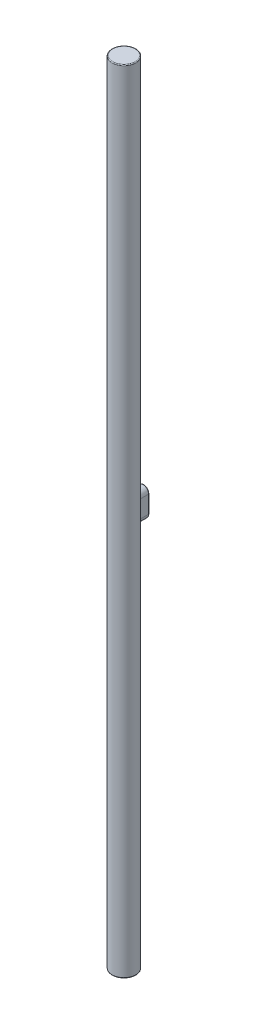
ISO-10303-21;
HEADER;
FILE_DESCRIPTION(('STEP AP214'),'2;1');
FILE_NAME('part.step','',(''),(''),'','','');
FILE_SCHEMA(('AUTOMOTIVE_DESIGN { 1 0 10303 214 1 1 1 1 }'));
ENDSEC;
DATA;
#1=APPLICATION_CONTEXT('core data for automotive mechanical design processes');
#2=APPLICATION_PROTOCOL_DEFINITION('international standard','automotive_design',2000,#1);
#3=PRODUCT_CONTEXT('',#1,'mechanical');
#4=PRODUCT('Part','Part','',(#3));
#5=PRODUCT_RELATED_PRODUCT_CATEGORY('part','',(#4));
#6=PRODUCT_DEFINITION_FORMATION('','',#4);
#7=PRODUCT_DEFINITION_CONTEXT('part definition',#1,'design');
#8=PRODUCT_DEFINITION('design','',#6,#7);
#9=PRODUCT_DEFINITION_SHAPE('','',#8);
#10=(LENGTH_UNIT() NAMED_UNIT(*) SI_UNIT(.MILLI.,.METRE.));
#11=(NAMED_UNIT(*) PLANE_ANGLE_UNIT() SI_UNIT($,.RADIAN.));
#12=(NAMED_UNIT(*) SI_UNIT($,.STERADIAN.) SOLID_ANGLE_UNIT());
#13=UNCERTAINTY_MEASURE_WITH_UNIT(LENGTH_MEASURE(1.E-05),#10,'distance_accuracy_value','');
#14=(GEOMETRIC_REPRESENTATION_CONTEXT(3) GLOBAL_UNCERTAINTY_ASSIGNED_CONTEXT((#13)) GLOBAL_UNIT_ASSIGNED_CONTEXT((#10,
#11,#12)) REPRESENTATION_CONTEXT('',''));
#15=CARTESIAN_POINT('',(0.,0.,0.));
#16=DIRECTION('',(0.,0.,1.));
#17=DIRECTION('',(1.,0.,0.));
#18=AXIS2_PLACEMENT_3D('',#15,#16,#17);
#19=CARTESIAN_POINT('',(0.,500.,0.));
#20=DIRECTION('',(0.,-1.,0.));
#21=DIRECTION('',(0.,0.,-1.));
#22=AXIS2_PLACEMENT_3D('',#19,#20,#21);
#23=CYLINDRICAL_SURFACE('',#22,15.);
#24=DIRECTION('',(0.,-1.,0.));
#25=VECTOR('',#24,1.);
#26=CARTESIAN_POINT('',(-7.0000000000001,500.,-13.2664991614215));
#27=LINE('',#26,#25);
#28=CARTESIAN_POINT('',(-7.00000000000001,11.,-13.2664991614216));
#29=VERTEX_POINT('',#28);
#30=CARTESIAN_POINT('',(-7.,-11.,-13.2664991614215));
#31=VERTEX_POINT('',#30);
#32=EDGE_CURVE('E121',#29,#31,#27,.T.);
#33=ORIENTED_EDGE('',*,*,#32,.T.);
#34=CARTESIAN_POINT('',(-7.,-11.,-13.2664991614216));
#35=CARTESIAN_POINT('',(-7.00003274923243,-11.1851244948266,-13.2664498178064));
#36=CARTESIAN_POINT('',(-6.99265774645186,-11.3702267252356,-13.2703724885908));
#37=CARTESIAN_POINT('',(-6.96334178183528,-11.7388617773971,-13.2857958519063));
#38=CARTESIAN_POINT('',(-6.94140847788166,-11.9223953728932,-13.2972925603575));
#39=CARTESIAN_POINT('',(-6.88337286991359,-12.2856402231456,-13.3274219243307));
#40=CARTESIAN_POINT('',(-6.84734316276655,-12.4653661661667,-13.3460180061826));
#41=CARTESIAN_POINT('',(-6.76154095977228,-12.8207064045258,-13.3896935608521));
#42=CARTESIAN_POINT('',(-6.71176716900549,-12.9963203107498,-13.4147736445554));
#43=CARTESIAN_POINT('',(-6.59910143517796,-13.3419716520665,-13.4705527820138));
#44=CARTESIAN_POINT('',(-6.5362358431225,-13.5120195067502,-13.5012405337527));
#45=CARTESIAN_POINT('',(-6.39789853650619,-13.8459808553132,-13.5673421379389));
#46=CARTESIAN_POINT('',(-6.32242204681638,-14.0098919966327,-13.6027577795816));
#47=CARTESIAN_POINT('',(-6.07778751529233,-14.4914233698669,-13.7146880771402));
#48=CARTESIAN_POINT('',(-5.89046347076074,-14.7987228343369,-13.7968658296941));
#49=CARTESIAN_POINT('',(-5.45752973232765,-15.4002848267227,-13.9740416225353));
#50=CARTESIAN_POINT('',(-5.20873505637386,-15.6920886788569,-14.0695353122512));
#51=CARTESIAN_POINT('',(-4.66630119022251,-16.2318046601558,-14.2586072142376));
#52=CARTESIAN_POINT('',(-4.37265100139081,-16.4797059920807,-14.3521849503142));
#53=CARTESIAN_POINT('',(-3.89437528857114,-16.8202410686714,-14.4866677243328));
#54=CARTESIAN_POINT('',(-3.7235235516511,-16.9310201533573,-14.5316262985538));
#55=CARTESIAN_POINT('',(-3.3720223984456,-17.1376677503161,-14.6171854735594));
#56=CARTESIAN_POINT('',(-3.19137712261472,-17.2335424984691,-14.6577878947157));
#57=CARTESIAN_POINT('',(-2.82147212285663,-17.4094652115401,-14.7334632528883));
#58=CARTESIAN_POINT('',(-2.63221405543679,-17.4895162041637,-14.768537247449));
#59=CARTESIAN_POINT('',(-2.24641271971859,-17.6329454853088,-14.8321215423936));
#60=CARTESIAN_POINT('',(-2.04987011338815,-17.6963252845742,-14.8606324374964));
#61=CARTESIAN_POINT('',(-1.66371033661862,-17.8021742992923,-14.9086383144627));
#62=CARTESIAN_POINT('',(-1.47444294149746,-17.8457136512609,-14.9285899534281));
#63=CARTESIAN_POINT('',(-1.09234411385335,-17.9169751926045,-14.9614017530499));
#64=CARTESIAN_POINT('',(-0.899512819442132,-17.9446979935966,-14.9742621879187));
#65=CARTESIAN_POINT('',(-0.511939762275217,-17.9839703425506,-14.9925161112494));
#66=CARTESIAN_POINT('',(-0.317198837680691,-17.9955266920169,-14.9979127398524));
#67=CARTESIAN_POINT('',(0.0726257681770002,-18.0023368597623,-15.0010903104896));
#68=CARTESIAN_POINT('',(0.267709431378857,-17.9975915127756,-14.9988716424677));
#69=CARTESIAN_POINT('',(0.641717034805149,-17.9728473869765,-14.9873445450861));
#70=CARTESIAN_POINT('',(0.820738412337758,-17.9540398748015,-14.9785898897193));
#71=CARTESIAN_POINT('',(1.17645951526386,-17.9027707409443,-14.9548562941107));
#72=CARTESIAN_POINT('',(1.35315842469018,-17.8703044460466,-14.9398752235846));
#73=CARTESIAN_POINT('',(1.7029066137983,-17.7920696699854,-14.9040599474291));
#74=CARTESIAN_POINT('',(1.87595719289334,-17.7463060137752,-14.8832278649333));
#75=CARTESIAN_POINT('',(2.21744279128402,-17.6419006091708,-14.8361946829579));
#76=CARTESIAN_POINT('',(2.38587601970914,-17.5832539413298,-14.8099915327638));
#77=CARTESIAN_POINT('',(2.71948708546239,-17.4526685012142,-14.7524047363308));
#78=CARTESIAN_POINT('',(2.8845823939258,-17.380549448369,-14.7209515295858));
#79=CARTESIAN_POINT('',(3.20807160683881,-17.22419439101,-14.6538602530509));
#80=CARTESIAN_POINT('',(3.36646305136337,-17.1399539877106,-14.6182206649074));
#81=CARTESIAN_POINT('',(3.83032730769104,-16.8699591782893,-14.5061886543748));
#82=CARTESIAN_POINT('',(4.12468757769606,-16.6668532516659,-14.4246474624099));
#83=CARTESIAN_POINT('',(4.7014055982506,-16.2005767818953,-14.2476513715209));
#84=CARTESIAN_POINT('',(4.9806178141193,-15.933768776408,-14.1516029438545));
#85=CARTESIAN_POINT('',(5.49207336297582,-15.357234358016,-13.9610763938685));
#86=CARTESIAN_POINT('',(5.72428311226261,-15.0474775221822,-13.8665994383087));
#87=CARTESIAN_POINT('',(6.03795030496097,-14.5474792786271,-13.7316077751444));
#88=CARTESIAN_POINT('',(6.13867739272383,-14.3702200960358,-13.6867493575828));
#89=CARTESIAN_POINT('',(6.32466275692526,-14.0067033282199,-13.6018041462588));
#90=CARTESIAN_POINT('',(6.40992781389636,-13.8204497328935,-13.5617152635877));
#91=CARTESIAN_POINT('',(6.56402317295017,-13.4404053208,-13.4878059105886));
#92=CARTESIAN_POINT('',(6.63287915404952,-13.2466268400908,-13.4539756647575));
#93=CARTESIAN_POINT('',(6.7534883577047,-12.85278346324,-13.3938392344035));
#94=CARTESIAN_POINT('',(6.80524910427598,-12.6527213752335,-13.3675297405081));
#95=CARTESIAN_POINT('',(6.89835333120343,-12.2130277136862,-13.3197587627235));
#96=CARTESIAN_POINT('',(6.93638471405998,-11.972497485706,-13.2999040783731));
#97=CARTESIAN_POINT('',(6.97450458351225,-11.6092331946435,-13.279927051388));
#98=CARTESIAN_POINT('',(6.98405670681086,-11.4876733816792,-13.2749021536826));
#99=CARTESIAN_POINT('',(6.99680619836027,-11.244086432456,-13.2681849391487));
#100=CARTESIAN_POINT('',(7.0000013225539,-11.1220591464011,-13.2664937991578));
#101=CARTESIAN_POINT('',(7.,-11.,-13.2664991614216));
#102=B_SPLINE_CURVE_WITH_KNOTS('',3,(#34,#35,#36,#37,#38,#39,#40,#41,#42,#43,#44,#45,#46,#47,
#48,#49,#50,#51,#52,#53,#54,#55,#56,#57,#58,#59,#60,#61,#62,#63,#64,#65,#66,#67,#68,#69,#70,#71,
#72,#73,#74,#75,#76,#77,#78,#79,#80,#81,#82,#83,#84,#85,#86,#87,#88,#89,#90,#91,#92,#93,#94,#95,
#96,#97,#98,#99,#100,#101),.UNSPECIFIED.,.F.,.F.,(4,2,2,2,2,2,2,2,2,2,2,2,2,2,2,2,2,2,2,2,2,2,2,
2,2,2,2,2,2,2,2,2,2,4),(0.,0.555149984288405,1.11000818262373,1.66204568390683,2.21413521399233,
2.76512406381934,3.31632202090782,4.41909352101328,5.59984914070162,6.78089474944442,
7.40580354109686,8.03045016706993,8.65497715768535,9.27944753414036,9.8643670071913,
10.4492638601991,11.0339145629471,11.6185353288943,12.158556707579,12.6987629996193,
13.2387735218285,13.7789906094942,14.3270350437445,14.8752788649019,15.971127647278,
17.1600982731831,18.3499154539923,18.9755024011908,19.6008143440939,20.2251411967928,
20.8491929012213,21.5803389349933,21.9462710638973,22.3123323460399),.UNSPECIFIED.);
#103=CARTESIAN_POINT('',(7.,-11.,-13.2664991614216));
#104=VERTEX_POINT('',#103);
#105=EDGE_CURVE('E101',#31,#104,#102,.T.);
#106=ORIENTED_EDGE('',*,*,#105,.T.);
#107=DIRECTION('',(0.,-1.,0.));
#108=VECTOR('',#107,1.);
#109=CARTESIAN_POINT('',(6.9999999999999,500.,-13.2664991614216));
#110=LINE('',#109,#108);
#111=CARTESIAN_POINT('',(6.9999999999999,11.,-13.2664991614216));
#112=VERTEX_POINT('',#111);
#113=EDGE_CURVE('E111',#104,#112,#110,.F.);
#114=ORIENTED_EDGE('',*,*,#113,.T.);
#115=CARTESIAN_POINT('',(0.,18.,-15.));
#116=CARTESIAN_POINT('',(-0.185527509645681,17.9999987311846,-14.9999989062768));
#117=CARTESIAN_POINT('',(-0.371089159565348,17.9926149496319,-14.9965492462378));
#118=CARTESIAN_POINT('',(-0.740864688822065,17.963156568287,-14.9828363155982));
#119=CARTESIAN_POINT('',(-0.925077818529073,17.9410743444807,-14.9725695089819));
#120=CARTESIAN_POINT('',(-1.29101586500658,17.8824175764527,-14.9454673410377));
#121=CARTESIAN_POINT('',(-1.47273599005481,17.8458183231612,-14.928620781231));
#122=CARTESIAN_POINT('',(-1.8321376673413,17.7585122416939,-14.8887870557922));
#123=CARTESIAN_POINT('',(-2.00981753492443,17.7077996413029,-14.8657973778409));
#124=CARTESIAN_POINT('',(-2.35915888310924,17.5930291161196,-14.8143651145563));
#125=CARTESIAN_POINT('',(-2.53084229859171,17.5290275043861,-14.7859455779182));
#126=CARTESIAN_POINT('',(-2.86799253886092,17.3881154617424,-14.7242659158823));
#127=CARTESIAN_POINT('',(-3.03345697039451,17.3112001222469,-14.6910039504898));
#128=CARTESIAN_POINT('',(-3.35710712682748,17.1451512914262,-14.6204390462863));
#129=CARTESIAN_POINT('',(-3.51529725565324,17.0560253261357,-14.5831385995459));
#130=CARTESIAN_POINT('',(-3.82374236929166,16.8661597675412,-14.5053212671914));
#131=CARTESIAN_POINT('',(-3.97399442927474,16.7654159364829,-14.4648032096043));
#132=CARTESIAN_POINT('',(-4.42760170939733,16.4351670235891,-14.3352174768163));
#133=CARTESIAN_POINT('',(-4.71623752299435,16.1866208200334,-14.2420761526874));
#134=CARTESIAN_POINT('',(-5.24943713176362,15.6462489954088,-14.0543075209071));
#135=CARTESIAN_POINT('',(-5.49397191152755,15.3543951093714,-13.9596792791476));
#136=CARTESIAN_POINT('',(-5.83075411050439,14.8785879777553,-13.8209401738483));
#137=CARTESIAN_POINT('',(-5.94080662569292,14.7078579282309,-13.7738664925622));
#138=CARTESIAN_POINT('',(-6.1460185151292,14.3567480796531,-13.6835306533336));
#139=CARTESIAN_POINT('',(-6.2411840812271,14.1763723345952,-13.640266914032));
#140=CARTESIAN_POINT('',(-6.41576799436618,13.8070684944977,-13.5590265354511));
#141=CARTESIAN_POINT('',(-6.4951904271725,13.6181426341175,-13.5210485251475));
#142=CARTESIAN_POINT('',(-6.63747055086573,13.2329619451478,-13.4517751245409));
#143=CARTESIAN_POINT('',(-6.70032982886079,13.0367078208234,-13.4204790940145));
#144=CARTESIAN_POINT('',(-6.80567082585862,12.6494932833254,-13.3673531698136));
#145=CARTESIAN_POINT('',(-6.84909352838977,12.4588480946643,-13.3450926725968));
#146=CARTESIAN_POINT('',(-6.91991023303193,12.0738452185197,-13.308509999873));
#147=CARTESIAN_POINT('',(-6.94730483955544,11.8794876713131,-13.2941875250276));
#148=CARTESIAN_POINT('',(-6.98566539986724,11.4888472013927,-13.2740706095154));
#149=CARTESIAN_POINT('',(-6.99664232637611,11.2925656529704,-13.268270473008));
#150=CARTESIAN_POINT('',(-7.00203713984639,10.8997185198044,-13.2654245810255));
#151=CARTESIAN_POINT('',(-6.9964562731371,10.703152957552,-13.2683781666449));
#152=CARTESIAN_POINT('',(-6.97022504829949,10.3313397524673,-13.2821739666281));
#153=CARTESIAN_POINT('',(-6.95115599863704,10.1559468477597,-13.2921880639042));
#154=CARTESIAN_POINT('',(-6.89993033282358,9.80753469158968,-13.3188511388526));
#155=CARTESIAN_POINT('',(-6.86776931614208,9.63451625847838,-13.3355023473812));
#156=CARTESIAN_POINT('',(-6.79071696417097,9.29208944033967,-13.3749029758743));
#157=CARTESIAN_POINT('',(-6.74582796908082,9.12268039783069,-13.3976512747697));
#158=CARTESIAN_POINT('',(-6.64374391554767,8.78838761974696,-13.4485656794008));
#159=CARTESIAN_POINT('',(-6.58654406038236,8.62350567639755,-13.476733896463));
#160=CARTESIAN_POINT('',(-6.45890740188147,8.29552875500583,-13.5383766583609));
#161=CARTESIAN_POINT('',(-6.38820027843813,8.13255870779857,-13.5719568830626));
#162=CARTESIAN_POINT('',(-6.23500689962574,7.81313368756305,-13.6430140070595));
#163=CARTESIAN_POINT('',(-6.15251670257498,7.65668091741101,-13.6804922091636));
#164=CARTESIAN_POINT('',(-5.88811674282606,7.19810690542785,-13.7973596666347));
#165=CARTESIAN_POINT('',(-5.68921430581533,6.90660842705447,-13.8812136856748));
#166=CARTESIAN_POINT('',(-5.34868196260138,6.48008319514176,-14.0145878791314));
#167=CARTESIAN_POINT('',(-5.22097547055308,6.33316946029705,-14.062774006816));
#168=CARTESIAN_POINT('',(-4.95377039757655,6.0504618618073,-14.1591066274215));
#169=CARTESIAN_POINT('',(-4.81427497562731,5.91466503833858,-14.2072531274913));
#170=CARTESIAN_POINT('',(-4.52411760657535,5.65487840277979,-14.3022965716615));
#171=CARTESIAN_POINT('',(-4.37344759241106,5.53089727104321,-14.3491925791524));
#172=CARTESIAN_POINT('',(-4.06185463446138,5.29566653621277,-14.4404874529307));
#173=CARTESIAN_POINT('',(-3.90093579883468,5.18441188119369,-14.4848873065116));
#174=CARTESIAN_POINT('',(-3.56364449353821,4.97159845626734,-14.5716107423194));
#175=CARTESIAN_POINT('',(-3.38692345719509,4.87053656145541,-14.6138009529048));
#176=CARTESIAN_POINT('',(-3.02450952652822,4.68384062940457,-14.6930843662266));
#177=CARTESIAN_POINT('',(-2.8388206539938,4.59819975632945,-14.7301798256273));
#178=CARTESIAN_POINT('',(-2.45973540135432,4.44320063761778,-14.7982015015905));
#179=CARTESIAN_POINT('',(-2.26634150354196,4.37383719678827,-14.8291296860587));
#180=CARTESIAN_POINT('',(-1.87328306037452,4.25217654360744,-14.8838894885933));
#181=CARTESIAN_POINT('',(-1.67361913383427,4.19987765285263,-14.9077218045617));
#182=CARTESIAN_POINT('',(-1.2849064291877,4.11628636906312,-14.9460444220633));
#183=CARTESIAN_POINT('',(-1.09618911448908,4.08370962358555,-14.9611026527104));
#184=CARTESIAN_POINT('',(-0.716291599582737,4.03411066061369,-14.9840958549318));
#185=CARTESIAN_POINT('',(-0.525111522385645,4.01708766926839,-14.9920311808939));
#186=CARTESIAN_POINT('',(-0.141899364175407,3.99881076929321,-15.0005528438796));
#187=CARTESIAN_POINT('',(0.0501324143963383,3.9975516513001,-15.0011416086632));
#188=CARTESIAN_POINT('',(0.433528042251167,4.01080539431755,-14.9949593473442));
#189=CARTESIAN_POINT('',(0.624891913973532,4.02531772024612,-14.9881885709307));
#190=CARTESIAN_POINT('',(0.992870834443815,4.06846060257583,-14.9681629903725));
#191=CARTESIAN_POINT('',(1.16962816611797,4.09609987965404,-14.9553639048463));
#192=CARTESIAN_POINT('',(1.52005950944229,4.16470144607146,-14.9238191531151));
#193=CARTESIAN_POINT('',(1.69373244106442,4.20566830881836,-14.9050714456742));
#194=CARTESIAN_POINT('',(2.03675771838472,4.30050187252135,-14.8620823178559));
#195=CARTESIAN_POINT('',(2.20611137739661,4.35436459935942,-14.8378425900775));
#196=CARTESIAN_POINT('',(2.53960724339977,4.47452478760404,-14.7844151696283));
#197=CARTESIAN_POINT('',(2.70374743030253,4.54082700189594,-14.7552255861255));
#198=CARTESIAN_POINT('',(3.03073676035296,4.6874965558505,-14.6916030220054));
#199=CARTESIAN_POINT('',(3.19339683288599,4.7682285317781,-14.6570381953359));
#200=CARTESIAN_POINT('',(3.51134517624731,4.94167648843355,-14.584138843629));
#201=CARTESIAN_POINT('',(3.6666307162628,5.03439686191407,-14.5458029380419));
#202=CARTESIAN_POINT('',(4.12023182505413,5.32957304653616,-14.4264075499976));
#203=CARTESIAN_POINT('',(4.40646643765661,5.54912277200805,-14.3409250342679));
#204=CARTESIAN_POINT('',(4.96471930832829,6.04982570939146,-14.1578733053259));
#205=CARTESIAN_POINT('',(5.23328196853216,6.33469554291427,-14.0599018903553));
#206=CARTESIAN_POINT('',(5.59821974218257,6.79307552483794,-13.9167925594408));
#207=CARTESIAN_POINT('',(5.71362151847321,6.95118059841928,-13.8696962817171));
#208=CARTESIAN_POINT('',(5.93107342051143,7.27700624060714,-13.7781079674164));
#209=CARTESIAN_POINT('',(6.03312871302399,7.4447230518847,-13.733614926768));
#210=CARTESIAN_POINT('',(6.22628880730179,7.79460207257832,-13.6471574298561));
#211=CARTESIAN_POINT('',(6.31692040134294,7.97705847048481,-13.605325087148));
#212=CARTESIAN_POINT('',(6.48226486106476,8.35012418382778,-13.5273278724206));
#213=CARTESIAN_POINT('',(6.55698529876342,8.54072956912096,-13.4911603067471));
#214=CARTESIAN_POINT('',(6.68967957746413,8.92872193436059,-13.4258579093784));
#215=CARTESIAN_POINT('',(6.74766458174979,9.12610429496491,-13.3967183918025));
#216=CARTESIAN_POINT('',(6.84618962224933,9.52619083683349,-13.3466383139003));
#217=CARTESIAN_POINT('',(6.88673191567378,9.7288943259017,-13.3256966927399));
#218=CARTESIAN_POINT('',(6.94693568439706,10.119365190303,-13.2944019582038));
#219=CARTESIAN_POINT('',(6.96815027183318,10.3068313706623,-13.2832643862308));
#220=CARTESIAN_POINT('',(6.99536983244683,10.6831655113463,-13.2689503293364));
#221=CARTESIAN_POINT('',(7.00137576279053,10.8720333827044,-13.2657733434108));
#222=CARTESIAN_POINT('',(6.99809627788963,11.2495502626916,-13.2675035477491));
#223=CARTESIAN_POINT('',(6.98881457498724,11.4381993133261,-13.2724087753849));
#224=CARTESIAN_POINT('',(6.95509456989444,11.8137582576,-13.290109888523));
#225=CARTESIAN_POINT('',(6.93065662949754,12.0006681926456,-13.3029055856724));
#226=CARTESIAN_POINT('',(6.8692843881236,12.3576820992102,-13.3346925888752));
#227=CARTESIAN_POINT('',(6.83339644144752,12.5280143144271,-13.3531614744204));
#228=CARTESIAN_POINT('',(6.7492425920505,12.8649072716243,-13.3958930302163));
#229=CARTESIAN_POINT('',(6.70097250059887,13.0314667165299,-13.4201576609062));
#230=CARTESIAN_POINT('',(6.59251960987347,13.3597822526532,-13.4737648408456));
#231=CARTESIAN_POINT('',(6.53233858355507,13.5215390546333,-13.5031066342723));
#232=CARTESIAN_POINT('',(6.40052875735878,13.839518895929,-13.566081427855));
#233=CARTESIAN_POINT('',(6.32889554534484,13.9957397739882,-13.5997160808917));
#234=CARTESIAN_POINT('',(6.16962215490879,14.3119684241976,-13.6727441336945));
#235=CARTESIAN_POINT('',(6.0812384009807,14.4715478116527,-13.7123709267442));
#236=CARTESIAN_POINT('',(5.89263773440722,14.7828501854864,-13.7944698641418));
#237=CARTESIAN_POINT('',(5.7924167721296,14.9345704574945,-13.8369429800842));
#238=CARTESIAN_POINT('',(5.58073172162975,15.2294661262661,-13.9236674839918));
#239=CARTESIAN_POINT('',(5.46926511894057,15.3726396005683,-13.9679192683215));
#240=CARTESIAN_POINT('',(5.23568066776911,15.6497844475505,-14.0571433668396));
#241=CARTESIAN_POINT('',(5.11356215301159,15.7837552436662,-14.1021157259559));
#242=CARTESIAN_POINT('',(4.84643680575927,16.0548804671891,-14.1962694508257));
#243=CARTESIAN_POINT('',(4.7003634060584,16.1909977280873,-14.2454187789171));
#244=CARTESIAN_POINT('',(4.3968457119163,16.4504676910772,-14.3420047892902));
#245=CARTESIAN_POINT('',(4.23940499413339,16.5738243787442,-14.3894420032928));
#246=CARTESIAN_POINT('',(3.91380631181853,16.8070870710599,-14.4813935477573));
#247=CARTESIAN_POINT('',(3.74563849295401,16.916980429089,-14.525905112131));
#248=CARTESIAN_POINT('',(3.39976003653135,17.1222587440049,-14.6107261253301));
#249=CARTESIAN_POINT('',(3.22205385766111,17.2176504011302,-14.6510375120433));
#250=CARTESIAN_POINT('',(2.85900975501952,17.3926892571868,-14.7261758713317));
#251=CARTESIAN_POINT('',(2.67371235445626,17.4724095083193,-14.7610281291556));
#252=CARTESIAN_POINT('',(2.29606194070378,17.615804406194,-14.8244639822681));
#253=CARTESIAN_POINT('',(2.1037124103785,17.6794868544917,-14.853050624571));
#254=CARTESIAN_POINT('',(1.71380885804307,17.7899797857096,-14.9030669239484));
#255=CARTESIAN_POINT('',(1.51626804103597,17.8368293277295,-14.9245131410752));
#256=CARTESIAN_POINT('',(1.11729196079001,17.9132383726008,-14.9596693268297));
#257=CARTESIAN_POINT('',(0.91585936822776,17.9428093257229,-14.9733844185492));
#258=CARTESIAN_POINT('',(0.594975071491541,17.9756855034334,-14.9886652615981));
#259=CARTESIAN_POINT('',(0.476212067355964,17.9847985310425,-14.9929110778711));
#260=CARTESIAN_POINT('',(0.238304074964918,17.9969562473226,-14.9985788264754));
#261=CARTESIAN_POINT('',(0.119159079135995,18.0000008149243,-15.0000007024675));
#262=CARTESIAN_POINT('',(0.,18.,-15.));
#263=B_SPLINE_CURVE_WITH_KNOTS('',3,(#115,#116,#117,#118,#119,#120,#121,#122,#123,#124,#125,
#126,#127,#128,#129,#130,#131,#132,#133,#134,#135,#136,#137,#138,#139,#140,#141,#142,#143,#144,
#145,#146,#147,#148,#149,#150,#151,#152,#153,#154,#155,#156,#157,#158,#159,#160,#161,#162,#163,
#164,#165,#166,#167,#168,#169,#170,#171,#172,#173,#174,#175,#176,#177,#178,#179,#180,#181,#182,
#183,#184,#185,#186,#187,#188,#189,#190,#191,#192,#193,#194,#195,#196,#197,#198,#199,#200,#201,
#202,#203,#204,#205,#206,#207,#208,#209,#210,#211,#212,#213,#214,#215,#216,#217,#218,#219,#220,
#221,#222,#223,#224,#225,#226,#227,#228,#229,#230,#231,#232,#233,#234,#235,#236,#237,#238,#239,
#240,#241,#242,#243,#244,#245,#246,#247,#248,#249,#250,#251,#252,#253,#254,#255,#256,#257,#258,
#259,#260,#261,#262),.UNSPECIFIED.,.T.,.F.,(4,2,2,2,2,2,2,2,2,2,2,2,2,2,2,2,2,2,2,2,2,2,2,2,2,2,
2,2,2,2,2,2,2,2,2,2,2,2,2,2,2,2,2,2,2,2,2,2,2,2,2,2,2,2,2,2,2,2,2,2,2,2,2,2,2,2,2,2,2,2,2,2,2,
4),(0.,0.556463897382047,1.11321665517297,1.67092114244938,2.22885406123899,2.78446926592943,
3.34029614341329,3.89578196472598,4.45147105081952,5.6225504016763,6.7943974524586,
7.41925763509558,8.0438572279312,8.66829450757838,9.29267193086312,9.88222605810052,
10.4717579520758,11.0608956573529,11.6499890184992,12.1794981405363,12.7091853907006,
13.2387753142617,13.7685719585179,14.3103609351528,14.852331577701,15.9357488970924,
16.5368462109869,17.1377829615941,17.7391578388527,18.3402931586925,18.9631926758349,
19.5858153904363,20.2082391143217,20.8306016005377,21.4061427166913,21.9816551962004,
22.556977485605,23.132280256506,23.6697472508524,24.2073988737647,24.7448850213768,
25.2825769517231,25.8365253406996,26.390677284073,27.4984032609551,28.7034024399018,
29.3068236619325,29.9100105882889,30.5331266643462,31.1559455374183,31.7783479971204,
32.4006698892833,32.9668805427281,33.5330555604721,34.0990931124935,34.6651171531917,
35.1896844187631,35.7144293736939,36.2390962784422,36.763965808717,37.3234087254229,
37.8830435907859,38.4428038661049,39.0025991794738,39.6187477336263,40.2347032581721,
40.8512330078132,41.4674770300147,42.0807765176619,42.6937770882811,43.3053459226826,
43.9165090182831,44.2739029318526,44.6313039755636),.UNSPECIFIED.);
#264=EDGE_CURVE('E116',#112,#29,#263,.T.);
#265=ORIENTED_EDGE('',*,*,#264,.T.);
#266=EDGE_LOOP('',(#33,#106,#114,#265));
#267=FACE_BOUND('',#266,.T.);
#268=CARTESIAN_POINT('',(0.,-499.,0.));
#269=DIRECTION('',(0.,1.,0.));
#270=DIRECTION('',(0.,0.,1.));
#271=AXIS2_PLACEMENT_3D('',#268,#269,#270);
#272=CIRCLE('',#271,15.);
#273=CARTESIAN_POINT('',(0.,-499.,15.));
#274=VERTEX_POINT('',#273);
#275=EDGE_CURVE('E296',#274,#274,#272,.T.);
#276=ORIENTED_EDGE('',*,*,#275,.T.);
#277=EDGE_LOOP('',(#276));
#278=FACE_BOUND('',#277,.T.);
#279=CARTESIAN_POINT('',(0.,499.,0.));
#280=DIRECTION('',(0.,1.,0.));
#281=DIRECTION('',(0.,0.,1.));
#282=AXIS2_PLACEMENT_3D('',#279,#280,#281);
#283=CIRCLE('',#282,15.);
#284=CARTESIAN_POINT('',(0.,499.,15.));
#285=VERTEX_POINT('',#284);
#286=EDGE_CURVE('E293',#285,#285,#283,.F.);
#287=ORIENTED_EDGE('',*,*,#286,.T.);
#288=EDGE_LOOP('',(#287));
#289=FACE_BOUND('',#288,.T.);
#290=ADVANCED_FACE('F44',(#267,#278,#289),#23,.T.);
#291=CARTESIAN_POINT('',(0.,500.,0.));
#292=DIRECTION('',(0.,1.,0.));
#293=DIRECTION('',(0.,0.,1.));
#294=AXIS2_PLACEMENT_3D('',#291,#292,#293);
#295=PLANE('',#294);
#296=CARTESIAN_POINT('',(0.,500.,0.));
#297=DIRECTION('',(0.,1.,0.));
#298=DIRECTION('',(0.,0.,1.));
#299=AXIS2_PLACEMENT_3D('',#296,#297,#298);
#300=CIRCLE('',#299,14.);
#301=CARTESIAN_POINT('',(0.,500.,14.));
#302=VERTEX_POINT('',#301);
#303=EDGE_CURVE('E117',#302,#302,#300,.T.);
#304=ORIENTED_EDGE('',*,*,#303,.T.);
#305=EDGE_LOOP('',(#304));
#306=FACE_BOUND('',#305,.T.);
#307=ADVANCED_FACE('F145',(#306),#295,.T.);
#308=CARTESIAN_POINT('',(0.,-500.,0.));
#309=DIRECTION('',(0.,1.,0.));
#310=DIRECTION('',(0.,0.,1.));
#311=AXIS2_PLACEMENT_3D('',#308,#309,#310);
#312=PLANE('',#311);
#313=CARTESIAN_POINT('',(0.,-500.,0.));
#314=DIRECTION('',(0.,1.,0.));
#315=DIRECTION('',(0.,0.,1.));
#316=AXIS2_PLACEMENT_3D('',#313,#314,#315);
#317=CIRCLE('',#316,14.);
#318=CARTESIAN_POINT('',(0.,-500.,14.));
#319=VERTEX_POINT('',#318);
#320=EDGE_CURVE('E299',#319,#319,#317,.F.);
#321=ORIENTED_EDGE('',*,*,#320,.T.);
#322=EDGE_LOOP('',(#321));
#323=FACE_BOUND('',#322,.T.);
#324=ADVANCED_FACE('F147',(#323),#312,.F.);
#325=CARTESIAN_POINT('',(0.,-499.,0.));
#326=DIRECTION('',(0.,1.,0.));
#327=DIRECTION('',(0.,0.,1.));
#328=AXIS2_PLACEMENT_3D('',#325,#326,#327);
#329=TOROIDAL_SURFACE('',#328,14.,1.);
#330=ORIENTED_EDGE('',*,*,#320,.F.);
#331=EDGE_LOOP('',(#330));
#332=FACE_BOUND('',#331,.T.);
#333=ORIENTED_EDGE('',*,*,#275,.F.);
#334=EDGE_LOOP('',(#333));
#335=FACE_BOUND('',#334,.T.);
#336=ADVANCED_FACE('F150',(#332,#335),#329,.T.);
#337=CARTESIAN_POINT('',(0.,499.,0.));
#338=DIRECTION('',(0.,1.,0.));
#339=DIRECTION('',(0.,0.,1.));
#340=AXIS2_PLACEMENT_3D('',#337,#338,#339);
#341=TOROIDAL_SURFACE('',#340,14.,1.);
#342=ORIENTED_EDGE('',*,*,#286,.F.);
#343=EDGE_LOOP('',(#342));
#344=FACE_BOUND('',#343,.T.);
#345=ORIENTED_EDGE('',*,*,#303,.F.);
#346=EDGE_LOOP('',(#345));
#347=FACE_BOUND('',#346,.T.);
#348=ADVANCED_FACE('F143',(#344,#347),#341,.T.);
#349=CARTESIAN_POINT('',(0.,-11.,-25.));
#350=DIRECTION('',(0.,0.,1.));
#351=DIRECTION('',(1.,0.,0.));
#352=AXIS2_PLACEMENT_3D('',#349,#350,#351);
#353=CYLINDRICAL_SURFACE('',#352,7.);
#354=DIRECTION('',(0.,0.,1.));
#355=VECTOR('',#354,1.);
#356=CARTESIAN_POINT('',(-7.,-11.,-25.));
#357=LINE('',#356,#355);
#358=CARTESIAN_POINT('',(-7.,-11.,-24.));
#359=VERTEX_POINT('',#358);
#360=EDGE_CURVE('E289',#359,#31,#357,.T.);
#361=ORIENTED_EDGE('',*,*,#360,.F.);
#362=CARTESIAN_POINT('',(0.,-11.,-24.));
#363=DIRECTION('',(0.,0.,1.));
#364=DIRECTION('',(1.,0.,0.));
#365=AXIS2_PLACEMENT_3D('',#362,#363,#364);
#366=CIRCLE('',#365,7.);
#367=CARTESIAN_POINT('',(7.,-11.,-24.));
#368=VERTEX_POINT('',#367);
#369=EDGE_CURVE('E104',#359,#368,#366,.T.);
#370=ORIENTED_EDGE('',*,*,#369,.T.);
#371=DIRECTION('',(0.,0.,1.));
#372=VECTOR('',#371,1.);
#373=CARTESIAN_POINT('',(7.,-11.,-25.));
#374=LINE('',#373,#372);
#375=EDGE_CURVE('E97',#368,#104,#374,.T.);
#376=ORIENTED_EDGE('',*,*,#375,.T.);
#377=ORIENTED_EDGE('',*,*,#105,.F.);
#378=EDGE_LOOP('',(#361,#370,#376,#377));
#379=FACE_BOUND('',#378,.T.);
#380=ADVANCED_FACE('F99',(#379),#353,.T.);
#381=CARTESIAN_POINT('',(-7.,-11.,-25.));
#382=DIRECTION('',(-1.,0.,0.));
#383=DIRECTION('',(0.,-1.,0.));
#384=AXIS2_PLACEMENT_3D('',#381,#382,#383);
#385=PLANE('',#384);
#386=DIRECTION('',(0.,0.,1.));
#387=VECTOR('',#386,1.);
#388=CARTESIAN_POINT('',(-7.00000000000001,11.,-25.));
#389=LINE('',#388,#387);
#390=CARTESIAN_POINT('',(-7.00000000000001,11.,-24.));
#391=VERTEX_POINT('',#390);
#392=EDGE_CURVE('E287',#391,#29,#389,.T.);
#393=ORIENTED_EDGE('',*,*,#392,.F.);
#394=DIRECTION('',(0.,-1.,0.));
#395=VECTOR('',#394,1.);
#396=CARTESIAN_POINT('',(-7.,-11.,-24.));
#397=LINE('',#396,#395);
#398=EDGE_CURVE('E53',#391,#359,#397,.T.);
#399=ORIENTED_EDGE('',*,*,#398,.T.);
#400=ORIENTED_EDGE('',*,*,#360,.T.);
#401=ORIENTED_EDGE('',*,*,#32,.F.);
#402=EDGE_LOOP('',(#393,#399,#400,#401));
#403=FACE_BOUND('',#402,.T.);
#404=ADVANCED_FACE('F142',(#403),#385,.T.);
#405=CARTESIAN_POINT('',(0.,11.,-25.));
#406=DIRECTION('',(0.,0.,1.));
#407=DIRECTION('',(1.,0.,0.));
#408=AXIS2_PLACEMENT_3D('',#405,#406,#407);
#409=CYLINDRICAL_SURFACE('',#408,7.);
#410=DIRECTION('',(0.,0.,1.));
#411=VECTOR('',#410,1.);
#412=CARTESIAN_POINT('',(7.,11.,-25.));
#413=LINE('',#412,#411);
#414=CARTESIAN_POINT('',(7.,11.,-24.));
#415=VERTEX_POINT('',#414);
#416=EDGE_CURVE('E108',#415,#112,#413,.T.);
#417=ORIENTED_EDGE('',*,*,#416,.F.);
#418=CARTESIAN_POINT('',(0.,11.,-24.));
#419=DIRECTION('',(0.,0.,1.));
#420=DIRECTION('',(1.,0.,0.));
#421=AXIS2_PLACEMENT_3D('',#418,#419,#420);
#422=CIRCLE('',#421,7.);
#423=EDGE_CURVE('E13',#415,#391,#422,.T.);
#424=ORIENTED_EDGE('',*,*,#423,.T.);
#425=ORIENTED_EDGE('',*,*,#392,.T.);
#426=ORIENTED_EDGE('',*,*,#264,.F.);
#427=EDGE_LOOP('',(#417,#424,#425,#426));
#428=FACE_BOUND('',#427,.T.);
#429=ADVANCED_FACE('F195',(#428),#409,.T.);
#430=CARTESIAN_POINT('',(7.,-11.,-25.));
#431=DIRECTION('',(1.,0.,0.));
#432=DIRECTION('',(0.,1.,0.));
#433=AXIS2_PLACEMENT_3D('',#430,#431,#432);
#434=PLANE('',#433);
#435=ORIENTED_EDGE('',*,*,#375,.F.);
#436=DIRECTION('',(0.,1.,0.));
#437=VECTOR('',#436,1.);
#438=CARTESIAN_POINT('',(7.,11.,-24.));
#439=LINE('',#438,#437);
#440=EDGE_CURVE('E122',#368,#415,#439,.T.);
#441=ORIENTED_EDGE('',*,*,#440,.T.);
#442=ORIENTED_EDGE('',*,*,#416,.T.);
#443=ORIENTED_EDGE('',*,*,#113,.F.);
#444=EDGE_LOOP('',(#435,#441,#442,#443));
#445=FACE_BOUND('',#444,.T.);
#446=ADVANCED_FACE('F112',(#445),#434,.T.);
#447=CARTESIAN_POINT('',(0.,-11.,-25.));
#448=DIRECTION('',(0.,0.,1.));
#449=DIRECTION('',(1.,0.,0.));
#450=AXIS2_PLACEMENT_3D('',#447,#448,#449);
#451=PLANE('',#450);
#452=CARTESIAN_POINT('',(0.,11.,-25.));
#453=DIRECTION('',(0.,0.,1.));
#454=DIRECTION('',(1.,0.,0.));
#455=AXIS2_PLACEMENT_3D('',#452,#453,#454);
#456=CIRCLE('',#455,6.);
#457=CARTESIAN_POINT('',(-6.00000000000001,11.,-25.));
#458=VERTEX_POINT('',#457);
#459=CARTESIAN_POINT('',(6.,11.,-25.));
#460=VERTEX_POINT('',#459);
#461=EDGE_CURVE('E124',#458,#460,#456,.F.);
#462=ORIENTED_EDGE('',*,*,#461,.T.);
#463=DIRECTION('',(0.,1.,0.));
#464=VECTOR('',#463,1.);
#465=CARTESIAN_POINT('',(6.,-11.,-25.));
#466=LINE('',#465,#464);
#467=CARTESIAN_POINT('',(6.,-11.,-25.));
#468=VERTEX_POINT('',#467);
#469=EDGE_CURVE('E268',#460,#468,#466,.F.);
#470=ORIENTED_EDGE('',*,*,#469,.T.);
#471=CARTESIAN_POINT('',(0.,-11.,-25.));
#472=DIRECTION('',(0.,0.,1.));
#473=DIRECTION('',(1.,0.,0.));
#474=AXIS2_PLACEMENT_3D('',#471,#472,#473);
#475=CIRCLE('',#474,6.);
#476=CARTESIAN_POINT('',(-6.,-11.,-25.));
#477=VERTEX_POINT('',#476);
#478=EDGE_CURVE('E274',#468,#477,#475,.F.);
#479=ORIENTED_EDGE('',*,*,#478,.T.);
#480=DIRECTION('',(0.,-1.,0.));
#481=VECTOR('',#480,1.);
#482=CARTESIAN_POINT('',(-6.00000000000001,11.,-25.));
#483=LINE('',#482,#481);
#484=EDGE_CURVE('E277',#477,#458,#483,.F.);
#485=ORIENTED_EDGE('',*,*,#484,.T.);
#486=EDGE_LOOP('',(#462,#470,#479,#485));
#487=FACE_BOUND('',#486,.T.);
#488=ADVANCED_FACE('F207',(#487),#451,.F.);
#489=CARTESIAN_POINT('',(-6.,-11.,-24.));
#490=DIRECTION('',(0.,1.,0.));
#491=DIRECTION('',(-1.,0.,0.));
#492=AXIS2_PLACEMENT_3D('',#489,#490,#491);
#493=CYLINDRICAL_SURFACE('',#492,1.);
#494=CARTESIAN_POINT('',(-6.00000000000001,11.,-24.));
#495=DIRECTION('',(0.,1.,0.));
#496=DIRECTION('',(0.,0.,1.));
#497=AXIS2_PLACEMENT_3D('',#494,#495,#496);
#498=CIRCLE('',#497,1.);
#499=EDGE_CURVE('E270',#458,#391,#498,.T.);
#500=ORIENTED_EDGE('',*,*,#499,.F.);
#501=ORIENTED_EDGE('',*,*,#484,.F.);
#502=CARTESIAN_POINT('',(-6.,-11.,-24.));
#503=DIRECTION('',(0.,-1.,0.));
#504=DIRECTION('',(0.,0.,-1.));
#505=AXIS2_PLACEMENT_3D('',#502,#503,#504);
#506=CIRCLE('',#505,1.);
#507=EDGE_CURVE('E48',#359,#477,#506,.T.);
#508=ORIENTED_EDGE('',*,*,#507,.F.);
#509=ORIENTED_EDGE('',*,*,#398,.F.);
#510=EDGE_LOOP('',(#500,#501,#508,#509));
#511=FACE_BOUND('',#510,.T.);
#512=ADVANCED_FACE('F46',(#511),#493,.T.);
#513=CARTESIAN_POINT('',(0.,-11.,-24.));
#514=DIRECTION('',(0.,0.,1.));
#515=DIRECTION('',(1.,0.,0.));
#516=AXIS2_PLACEMENT_3D('',#513,#514,#515);
#517=TOROIDAL_SURFACE('',#516,6.,1.);
#518=ORIENTED_EDGE('',*,*,#507,.T.);
#519=ORIENTED_EDGE('',*,*,#478,.F.);
#520=CARTESIAN_POINT('',(6.,-11.,-24.));
#521=DIRECTION('',(0.,1.,0.));
#522=DIRECTION('',(0.,0.,1.));
#523=AXIS2_PLACEMENT_3D('',#520,#521,#522);
#524=CIRCLE('',#523,1.);
#525=EDGE_CURVE('E265',#368,#468,#524,.T.);
#526=ORIENTED_EDGE('',*,*,#525,.F.);
#527=ORIENTED_EDGE('',*,*,#369,.F.);
#528=EDGE_LOOP('',(#518,#519,#526,#527));
#529=FACE_BOUND('',#528,.T.);
#530=ADVANCED_FACE('F220',(#529),#517,.T.);
#531=CARTESIAN_POINT('',(0.,11.,-24.));
#532=DIRECTION('',(0.,0.,1.));
#533=DIRECTION('',(1.,0.,0.));
#534=AXIS2_PLACEMENT_3D('',#531,#532,#533);
#535=TOROIDAL_SURFACE('',#534,6.,1.);
#536=ORIENTED_EDGE('',*,*,#499,.T.);
#537=ORIENTED_EDGE('',*,*,#423,.F.);
#538=CARTESIAN_POINT('',(6.,11.,-24.));
#539=DIRECTION('',(0.,-1.,0.));
#540=DIRECTION('',(0.,0.,-1.));
#541=AXIS2_PLACEMENT_3D('',#538,#539,#540);
#542=CIRCLE('',#541,1.);
#543=EDGE_CURVE('E271',#460,#415,#542,.T.);
#544=ORIENTED_EDGE('',*,*,#543,.F.);
#545=ORIENTED_EDGE('',*,*,#461,.F.);
#546=EDGE_LOOP('',(#536,#537,#544,#545));
#547=FACE_BOUND('',#546,.T.);
#548=ADVANCED_FACE('F227',(#547),#535,.T.);
#549=CARTESIAN_POINT('',(6.,-11.,-24.));
#550=DIRECTION('',(0.,-1.,0.));
#551=DIRECTION('',(1.,0.,0.));
#552=AXIS2_PLACEMENT_3D('',#549,#550,#551);
#553=CYLINDRICAL_SURFACE('',#552,1.);
#554=ORIENTED_EDGE('',*,*,#525,.T.);
#555=ORIENTED_EDGE('',*,*,#469,.F.);
#556=ORIENTED_EDGE('',*,*,#543,.T.);
#557=ORIENTED_EDGE('',*,*,#440,.F.);
#558=EDGE_LOOP('',(#554,#555,#556,#557));
#559=FACE_BOUND('',#558,.T.);
#560=ADVANCED_FACE('F234',(#559),#553,.T.);
#561=CLOSED_SHELL('',(#290,#307,#324,#336,#348,#380,#404,#429,#446,#488,#512,#530,#548,#560));
#562=MANIFOLD_SOLID_BREP('B2',#561);
#563=ADVANCED_BREP_SHAPE_REPRESENTATION('',(#18,#562),#14);
#564=SHAPE_DEFINITION_REPRESENTATION(#9,#563);
ENDSEC;
END-ISO-10303-21;
